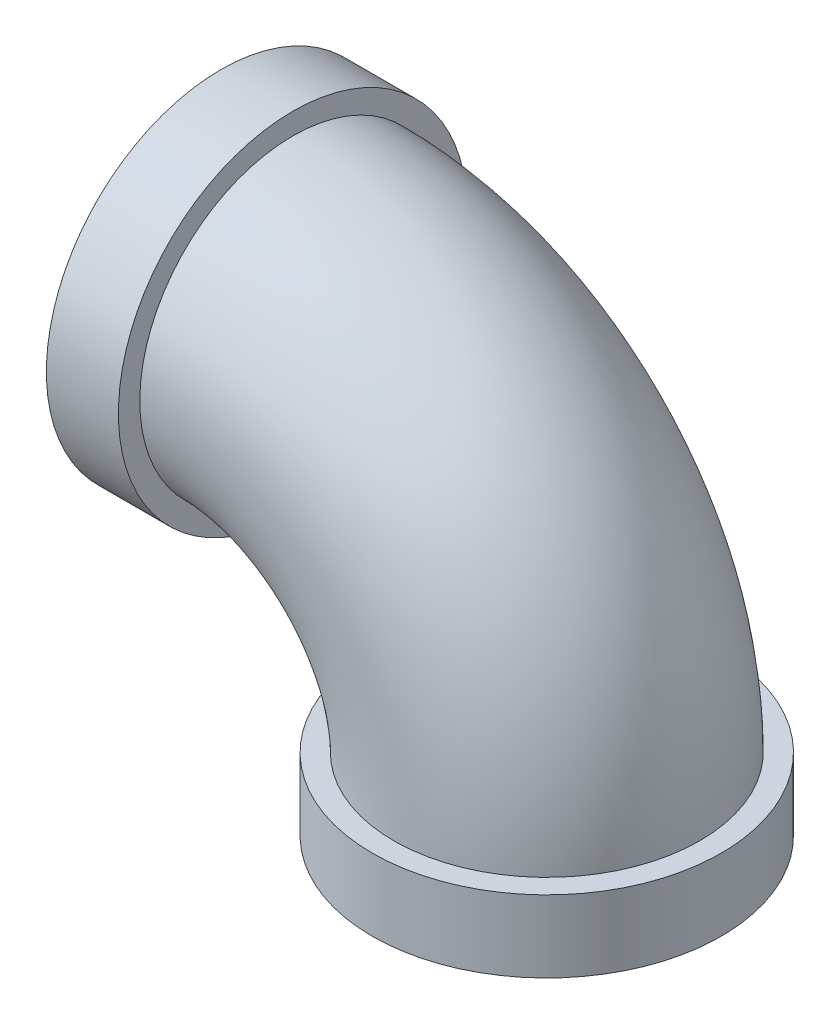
from build123d import *

# Parameters (mm, degrees)
SKETCH2_R           = 13.335
SKETCH2_R_2         = 7.62
SKETCH3_R           = 15.2019
BOSS_EXTRUDE1_DEPTH = 6.2738
SKETCH4_R           = 11.0998
CUT_EXTRUDE1_DEPTH  = 6.2738
SKETCH5_R           = 15.2019
BOSS_EXTRUDE2_DEPTH = 6.2738
SKETCH6_R           = 11.0998
CUT_EXTRUDE2_DEPTH  = 6.2738


with BuildPart() as part:
    # Sweep1: sweep along a path in ElbowArc
    with BuildLine(Plane.XY) as sweep1_path:
        ThreePointArc((22.1234, 0), (15.643606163, 15.643606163), (0, 22.1234))
    # Sketch2 → Sweep1 (sweep)
    with BuildSketch(Plane(origin=(0, 0, 0), x_dir=(1, 0, 0), z_dir=(0, 1, 0))):
        with Locations((22.1234, 0)):
            Circle(SKETCH2_R)
        with Locations((22.1234, 0)):
            Circle(SKETCH2_R_2, mode=Mode.SUBTRACT)
    sweep(path=sweep1_path.line)

    # Sketch3 → Boss-Extrude1 (add)
    with BuildSketch(Plane.XZ):
        with Locations(Location((22.1234, 0, 0), (0, 0, 90))):
            Circle(SKETCH3_R)
    extrude(amount=BOSS_EXTRUDE1_DEPTH)

    # Sketch4 → Cut-Extrude1 (cut)
    with BuildSketch(Plane.XZ.offset(6.2738)):
        with Locations(Location((22.1234, 0, 0), (0, 0, 270))):
            Circle(SKETCH4_R)
    extrude(amount=-CUT_EXTRUDE1_DEPTH, mode=Mode.SUBTRACT)

    # Sketch5 → Boss-Extrude2 (add)
    with BuildSketch(Plane(origin=(0, 0, 0), x_dir=(0, -1, 0), z_dir=(-1, 0, 0))):
        with Locations(Location((-22.1234, 0, 0), (0, 0, 180))):
            Circle(SKETCH5_R)
    extrude(amount=BOSS_EXTRUDE2_DEPTH)

    # Sketch6 → Cut-Extrude2 (cut)
    with BuildSketch(Plane(origin=(-6.2738, 0, 0), x_dir=(0, -1, 0), z_dir=(-1, 0, 0))):
        with Locations((-22.1234, 0)):
            Circle(SKETCH6_R)
    extrude(amount=-CUT_EXTRUDE2_DEPTH, mode=Mode.SUBTRACT)


solid = part.part
